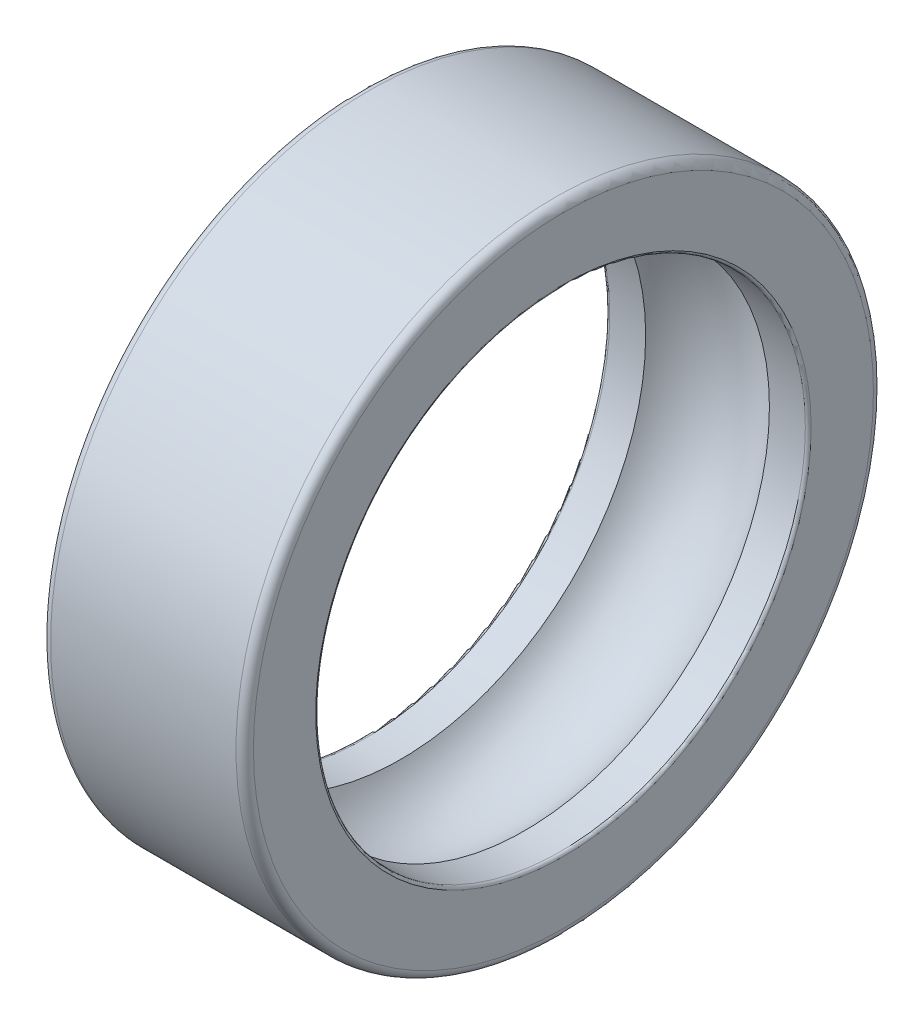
from build123d import *


with BuildPart() as part:
    # Sketch1 → Revolve1 (revolve)
    with BuildSketch(Plane.XY, mode=Mode.PRIVATE) as revolve1_sk:
        with BuildLine():
            Line((-0.025, 10.7), (-0.025, 8.6))
            ThreePointArc((-0.025, 8.6), (0.018933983, 8.493933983), (0.125, 8.45))
            Line((0.125, 8.45), (1.36458435, 8.45))
            ThreePointArc((1.36458435, 8.45), (3.5, 9.65), (5.63541565, 8.45))
            Line((5.63541565, 8.45), (6.875, 8.45))
            ThreePointArc((6.875, 8.45), (6.945710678, 8.479289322), (6.975, 8.55))
            Line((6.975, 8.55), (6.975, 10.7))
            ThreePointArc((6.975, 10.7), (6.887132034, 10.912132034), (6.675, 11))
            Line((6.675, 11), (0.275, 11))
            ThreePointArc((0.275, 11), (0.062867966, 10.912132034), (-0.025, 10.7))
        make_face()
    revolve(revolve1_sk.sketch.rotate(Axis((9, 0, 0), (-1, 0, 0)), 90), axis=Axis((9, 0, 0), (-1, 0, 0)))


solid = part.part
